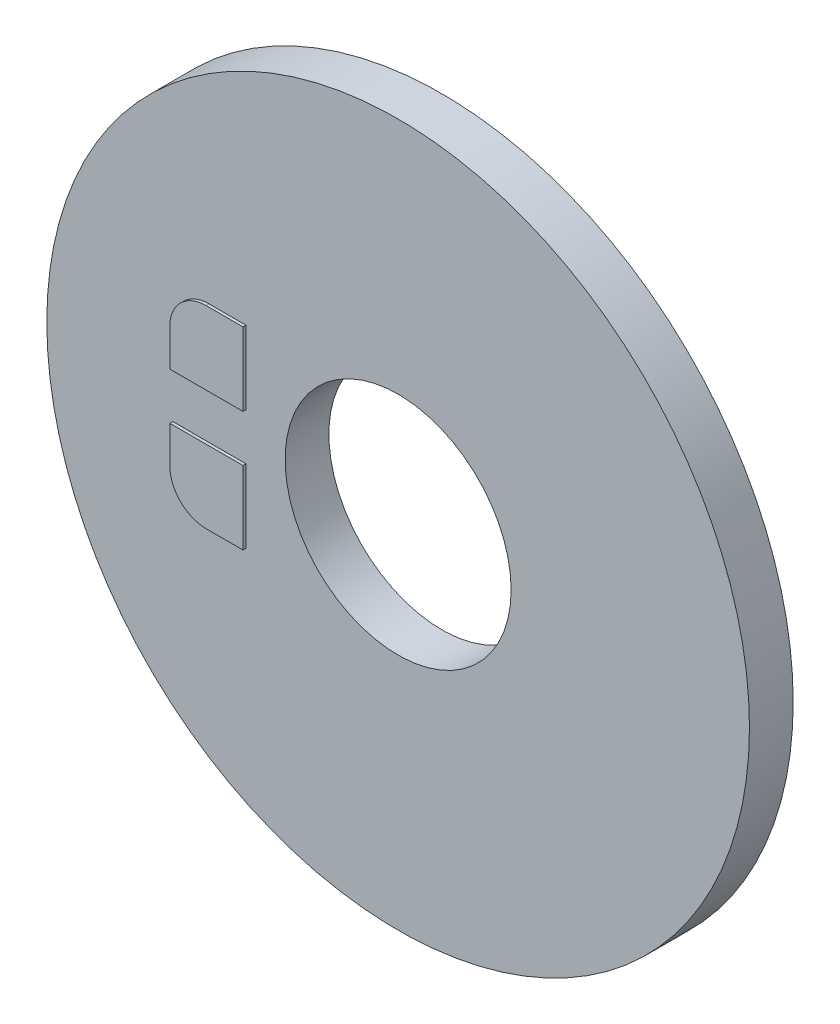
from build123d import *

# Parameters (mm, degrees)
SKETCH1_R               = 15.24
SKETCH1_R_2             = 4.7625
EXTRUDE1_DEPTH          = 1.89738
EXTRUDE3_DEPTH          = 0.127
EXTRUDE4_DEPTH          = 1.89738
CIRPATTERN1_COUNT       = 3
CUT_EXTRUDE1_DEPTH      = 10
CUT_EXTRUDE1_DEPTH_BACK = 2.54
SKETCH9_OUTSIDE_W       = 47.003
SKETCH9_OUTSIDE_H       = 46.972
SKETCH9_OUTSIDE_R       = 15.24
SKETCH9_OUTSIDE_R_2     = 4.9022


with BuildPart() as part:
    # Sketch1 → Extrude1 (new body)
    with BuildSketch(Plane.XY):
        with Locations(Location((0, 0, 0), (0, 0, 180))):
            Circle(SKETCH1_R)
        with Locations(Location((0, 0, 0), (0, 0, 180))):
            Circle(SKETCH1_R_2, mode=Mode.SUBTRACT)
    extrude(amount=EXTRUDE1_DEPTH)

    # Sketch3 → Extrude3 (add)
    with BuildSketch(Plane.XY.offset(1.89738)):
        with BuildLine():
            Line((-8.2042, 4.191), (-6.604, 4.191))
            Line((-6.604, 4.191), (-6.604, 1.016))
            Line((-6.604, 1.016), (-9.779, 1.016))
            Line((-9.779, 1.016), (-9.779, 2.6162))
            ThreePointArc((-9.779, 2.6162), (-9.317751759, 3.729751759), (-8.2042, 4.191))
        make_face()
    extrude3 = extrude(amount=EXTRUDE3_DEPTH)

    # Mirror1: Extrude3 across plane
    add(extrude3.mirror(Plane.ZX))

    # Sketch4 → Extrude4 (add)
    with BuildSketch(Plane.XY):
        with BuildLine():
            Line((15.022527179, -2.5654), (17.272, -2.5654))
            ThreePointArc((17.272, -2.5654), (19.8374, 0), (17.272, 2.5654))
            Line((17.272, 2.5654), (15.022527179, 2.5654))
            Line((15.022527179, 2.5654), (15.022527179, -2.5654))
        make_face()
    extrude4 = extrude(amount=EXTRUDE4_DEPTH)

    # CirPattern1: Extrude4 ×3 about axis
    cirpattern1_axis = Axis((0, 0, 0), (0, 0, 1))
    for i in range(1, CIRPATTERN1_COUNT):
        add(extrude4.rotate(cirpattern1_axis, i * 360 / CIRPATTERN1_COUNT))

    # Sketch9 outside → Cut-Extrude1 (cut, two sides: drawn at the far end of the back side and taken through both)
    # profile 1 of 2: a face of its own
    with BuildSketch(Plane.XY.offset(1.89738).offset(-CUT_EXTRUDE1_DEPTH_BACK)):
        with Locations((2.2985, 0)):
            Rectangle(SKETCH9_OUTSIDE_W, SKETCH9_OUTSIDE_H)
        with Locations(Location((0, 0, 0), (0, 0, 180))):
            Circle(SKETCH9_OUTSIDE_R, mode=Mode.SUBTRACT)
    # profile 2 of 2: a face of its own
    with BuildSketch(Plane.XY.offset(1.89738).offset(-CUT_EXTRUDE1_DEPTH_BACK)):
        Circle(SKETCH9_OUTSIDE_R_2)
    extrude(amount=CUT_EXTRUDE1_DEPTH + CUT_EXTRUDE1_DEPTH_BACK, mode=Mode.SUBTRACT)


solid = part.part
